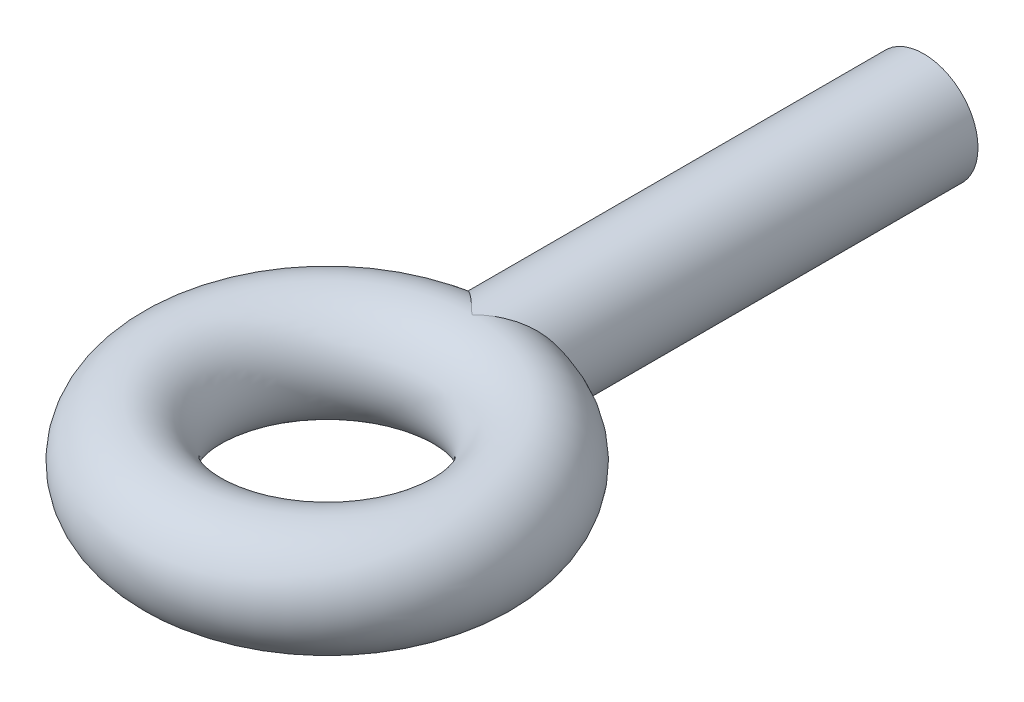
ISO-10303-21;
HEADER;
FILE_DESCRIPTION(('STEP AP214'),'2;1');
FILE_NAME('part.step','',(''),(''),'','','');
FILE_SCHEMA(('AUTOMOTIVE_DESIGN { 1 0 10303 214 1 1 1 1 }'));
ENDSEC;
DATA;
#1=APPLICATION_CONTEXT('core data for automotive mechanical design processes');
#2=APPLICATION_PROTOCOL_DEFINITION('international standard','automotive_design',2000,#1);
#3=PRODUCT_CONTEXT('',#1,'mechanical');
#4=PRODUCT('Part','Part','',(#3));
#5=PRODUCT_RELATED_PRODUCT_CATEGORY('part','',(#4));
#6=PRODUCT_DEFINITION_FORMATION('','',#4);
#7=PRODUCT_DEFINITION_CONTEXT('part definition',#1,'design');
#8=PRODUCT_DEFINITION('design','',#6,#7);
#9=PRODUCT_DEFINITION_SHAPE('','',#8);
#10=(LENGTH_UNIT() NAMED_UNIT(*) SI_UNIT(.MILLI.,.METRE.));
#11=(NAMED_UNIT(*) PLANE_ANGLE_UNIT() SI_UNIT($,.RADIAN.));
#12=(NAMED_UNIT(*) SI_UNIT($,.STERADIAN.) SOLID_ANGLE_UNIT());
#13=UNCERTAINTY_MEASURE_WITH_UNIT(LENGTH_MEASURE(1.E-05),#10,'distance_accuracy_value','');
#14=(GEOMETRIC_REPRESENTATION_CONTEXT(3) GLOBAL_UNCERTAINTY_ASSIGNED_CONTEXT((#13)) GLOBAL_UNIT_ASSIGNED_CONTEXT((#10,
#11,#12)) REPRESENTATION_CONTEXT('',''));
#15=CARTESIAN_POINT('',(0.,0.,0.));
#16=DIRECTION('',(0.,0.,1.));
#17=DIRECTION('',(1.,0.,0.));
#18=AXIS2_PLACEMENT_3D('',#15,#16,#17);
#19=CARTESIAN_POINT('',(0.,0.,66.));
#20=DIRECTION('',(0.,-1.,0.));
#21=DIRECTION('',(0.,0.,-1.));
#22=AXIS2_PLACEMENT_3D('',#19,#20,#21);
#23=TOROIDAL_SURFACE('',#22,16.,6.);
#24=CARTESIAN_POINT('',(0.,6.00000000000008,50.));
#25=CARTESIAN_POINT('',(0.00365142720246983,5.99999999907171,49.99634856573));
#26=CARTESIAN_POINT('',(0.00730353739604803,5.99999666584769,49.9926977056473));
#27=CARTESIAN_POINT('',(0.368796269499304,5.99933665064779,49.6314529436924));
#28=CARTESIAN_POINT('',(0.733142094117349,5.96666769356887,49.2794020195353));
#29=CARTESIAN_POINT('',(1.46591427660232,5.83011795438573,48.59231633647));
#30=CARTESIAN_POINT('',(1.83434639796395,5.72611920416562,48.2573107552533));
#31=CARTESIAN_POINT('',(2.51206206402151,5.45921564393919,47.6570671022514));
#32=CARTESIAN_POINT('',(2.82244829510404,5.3065091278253,47.3886042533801));
#33=CARTESIAN_POINT('',(3.42605073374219,4.93830714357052,46.8767440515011));
#34=CARTESIAN_POINT('',(3.7192920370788,4.72290635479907,46.6333096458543));
#35=CARTESIAN_POINT('',(4.22017294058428,4.27544708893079,46.2242873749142));
#36=CARTESIAN_POINT('',(4.43329412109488,4.05503493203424,46.0528121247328));
#37=CARTESIAN_POINT('',(4.73104107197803,3.69346406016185,45.8158581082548));
#38=CARTESIAN_POINT('',(4.82663415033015,3.56778183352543,45.7402499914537));
#39=CARTESIAN_POINT('',(5.00933699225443,3.30634877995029,45.5964723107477));
#40=CARTESIAN_POINT('',(5.09644796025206,3.17059938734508,45.5283016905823));
#41=CARTESIAN_POINT('',(5.24823807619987,2.91118416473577,45.4100373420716));
#42=CARTESIAN_POINT('',(5.31430804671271,2.78886159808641,45.358775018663));
#43=CARTESIAN_POINT('',(5.43862537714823,2.53790315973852,45.2626346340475));
#44=CARTESIAN_POINT('',(5.49687411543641,2.40926840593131,45.2177554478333));
#45=CARTESIAN_POINT('',(5.6047840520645,2.14629807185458,45.1348421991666));
#46=CARTESIAN_POINT('',(5.65444491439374,2.01196226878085,45.0968084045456));
#47=CARTESIAN_POINT('',(5.7444331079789,1.73844835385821,45.0280415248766));
#48=CARTESIAN_POINT('',(5.78476489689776,1.59927259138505,44.9973049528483));
#49=CARTESIAN_POINT('',(5.85567022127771,1.31624979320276,44.9433578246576));
#50=CARTESIAN_POINT('',(5.8861936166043,1.17238277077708,44.9201859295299));
#51=CARTESIAN_POINT('',(5.93668912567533,0.881745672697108,44.8818935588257));
#52=CARTESIAN_POINT('',(5.95666115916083,0.734975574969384,44.8667731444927));
#53=CARTESIAN_POINT('',(5.98569827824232,0.43978017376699,44.8448004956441));
#54=CARTESIAN_POINT('',(5.99476603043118,0.291355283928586,44.8379462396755));
#55=CARTESIAN_POINT('',(6.00183836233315,-0.00590293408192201,44.8325996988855));
#56=CARTESIAN_POINT('',(5.99984371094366,-0.154736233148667,44.8341068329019));
#57=CARTESIAN_POINT('',(5.9854629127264,-0.439047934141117,44.8449807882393));
#58=CARTESIAN_POINT('',(5.97396346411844,-0.574598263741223,44.8536769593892));
#59=CARTESIAN_POINT('',(5.94188552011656,-0.844042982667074,44.8779621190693));
#60=CARTESIAN_POINT('',(5.92130395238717,-0.977936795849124,44.8935534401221));
#61=CARTESIAN_POINT('',(5.87137303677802,-1.24304709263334,44.9314382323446));
#62=CARTESIAN_POINT('',(5.84202756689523,-1.37426473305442,44.9537287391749));
#63=CARTESIAN_POINT('',(5.77496546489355,-1.63330453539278,45.0047732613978));
#64=CARTESIAN_POINT('',(5.7372456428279,-1.76112538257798,45.0335297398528));
#65=CARTESIAN_POINT('',(5.65339744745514,-2.01422265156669,45.0976136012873));
#66=CARTESIAN_POINT('',(5.60716677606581,-2.13944489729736,45.1330210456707));
#67=CARTESIAN_POINT('',(5.50721413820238,-2.38499284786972,45.2098021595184));
#68=CARTESIAN_POINT('',(5.45348950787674,-2.50531679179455,45.2511779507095));
#69=CARTESIAN_POINT('',(5.28201866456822,-2.85806099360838,45.3836861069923));
#70=CARTESIAN_POINT('',(5.15391920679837,-3.08242031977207,45.4832420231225));
#71=CARTESIAN_POINT('',(4.85936799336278,-3.53082124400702,45.7141779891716));
#72=CARTESIAN_POINT('',(4.6901954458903,-3.75183325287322,45.8479056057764));
#73=CARTESIAN_POINT('',(4.33082673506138,-4.16151994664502,46.1352801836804));
#74=CARTESIAN_POINT('',(4.14061621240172,-4.35017231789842,46.2889407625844));
#75=CARTESIAN_POINT('',(3.79753142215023,-4.64930427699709,46.5697350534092));
#76=CARTESIAN_POINT('',(3.64805116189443,-4.76727524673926,46.6931676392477));
#77=CARTESIAN_POINT('',(3.34300981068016,-4.98593276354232,46.9476365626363));
#78=CARTESIAN_POINT('',(3.18744644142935,-5.08661275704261,47.078675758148));
#79=CARTESIAN_POINT('',(2.71386350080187,-5.36365021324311,47.4820185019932));
#80=CARTESIAN_POINT('',(2.38922614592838,-5.51477273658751,47.7643236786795));
#81=CARTESIAN_POINT('',(1.89091512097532,-5.69717392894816,48.2086312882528));
#82=CARTESIAN_POINT('',(1.71895655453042,-5.75125467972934,48.3639166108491));
#83=CARTESIAN_POINT('',(1.37478032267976,-5.84308842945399,48.6789788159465));
#84=CARTESIAN_POINT('',(1.20256265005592,-5.8808409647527,48.8387558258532));
#85=CARTESIAN_POINT('',(0.687874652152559,-5.97058674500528,49.3231942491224));
#86=CARTESIAN_POINT('',(0.346492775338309,-5.99937705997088,49.6537412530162));
#87=CARTESIAN_POINT('',(0.00730352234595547,-5.99999666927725,49.9926977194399));
#88=CARTESIAN_POINT('',(0.00365141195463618,-6.0000000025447,49.9963485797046));
#89=CARTESIAN_POINT('',(0.,-6.00000000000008,50.));
#90=B_SPLINE_CURVE_WITH_KNOTS('',3,(#24,#25,#26,#27,#28,#29,#30,#31,#32,#33,#34,#35,#36,#37,#38,
#39,#40,#41,#42,#43,#44,#45,#46,#47,#48,#49,#50,#51,#52,#53,#54,#55,#56,#57,#58,#59,#60,#61,#62,
#63,#64,#65,#66,#67,#68,#69,#70,#71,#72,#73,#74,#75,#76,#77,#78,#79,#80,#81,#82,#83,#84,#85,#86,
#87,#88,#89),.UNSPECIFIED.,.F.,.F.,(4,2,2,2,2,2,2,2,2,2,2,2,2,2,2,2,2,2,2,2,2,2,2,2,2,2,2,2,2,2,
2,2,4),(0.,0.0154919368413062,1.53313644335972,3.05329696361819,4.36213800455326,
5.66901263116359,6.71836517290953,7.24304017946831,7.76764057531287,8.21172315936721,
8.65572737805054,9.09974896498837,9.54355794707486,9.98960084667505,10.4356471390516,
10.8815843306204,11.3274905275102,11.7359514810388,12.1445507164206,12.5529694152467,
12.9615439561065,13.3753948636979,13.7893932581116,14.6168525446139,15.5398815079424,
16.4635444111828,17.1434501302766,17.8236129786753,19.1851945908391,19.8985016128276,
20.6118288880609,22.0348755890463,22.0503675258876),.UNSPECIFIED.);
#91=CARTESIAN_POINT('',(0.,6.,50.));
#92=VERTEX_POINT('',#91);
#93=CARTESIAN_POINT('',(0.,-6.,50.));
#94=VERTEX_POINT('',#93);
#95=EDGE_CURVE('E45',#92,#94,#90,.T.);
#96=ORIENTED_EDGE('',*,*,#95,.F.);
#97=CARTESIAN_POINT('',(0.,-6.00000000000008,50.));
#98=CARTESIAN_POINT('',(-0.0036514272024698,-5.99999999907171,49.99634856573));
#99=CARTESIAN_POINT('',(-0.00730353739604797,-5.99999666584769,49.9926977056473));
#100=CARTESIAN_POINT('',(-0.368796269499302,-5.99933665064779,49.6314529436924));
#101=CARTESIAN_POINT('',(-0.73314209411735,-5.96666769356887,49.2794020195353));
#102=CARTESIAN_POINT('',(-1.46591427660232,-5.83011795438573,48.59231633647));
#103=CARTESIAN_POINT('',(-1.83434639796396,-5.72611920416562,48.2573107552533));
#104=CARTESIAN_POINT('',(-2.51206206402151,-5.45921564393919,47.6570671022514));
#105=CARTESIAN_POINT('',(-2.82244829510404,-5.3065091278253,47.3886042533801));
#106=CARTESIAN_POINT('',(-3.42605073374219,-4.93830714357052,46.8767440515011));
#107=CARTESIAN_POINT('',(-3.7192920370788,-4.72290635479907,46.6333096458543));
#108=CARTESIAN_POINT('',(-4.22017294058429,-4.27544708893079,46.2242873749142));
#109=CARTESIAN_POINT('',(-4.43329412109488,-4.05503493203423,46.0528121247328));
#110=CARTESIAN_POINT('',(-4.73104107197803,-3.69346406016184,45.8158581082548));
#111=CARTESIAN_POINT('',(-4.82663415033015,-3.56778183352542,45.7402499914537));
#112=CARTESIAN_POINT('',(-5.00933699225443,-3.30634877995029,45.5964723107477));
#113=CARTESIAN_POINT('',(-5.09644796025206,-3.17059938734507,45.5283016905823));
#114=CARTESIAN_POINT('',(-5.24823807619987,-2.91118416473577,45.4100373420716));
#115=CARTESIAN_POINT('',(-5.31430804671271,-2.78886159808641,45.358775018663));
#116=CARTESIAN_POINT('',(-5.43862537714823,-2.53790315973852,45.2626346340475));
#117=CARTESIAN_POINT('',(-5.49687411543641,-2.40926840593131,45.2177554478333));
#118=CARTESIAN_POINT('',(-5.6047840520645,-2.14629807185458,45.1348421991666));
#119=CARTESIAN_POINT('',(-5.65444491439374,-2.01196226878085,45.0968084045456));
#120=CARTESIAN_POINT('',(-5.7444331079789,-1.7384483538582,45.0280415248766));
#121=CARTESIAN_POINT('',(-5.78476489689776,-1.59927259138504,44.9973049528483));
#122=CARTESIAN_POINT('',(-5.85567022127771,-1.31624979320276,44.9433578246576));
#123=CARTESIAN_POINT('',(-5.8861936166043,-1.17238277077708,44.9201859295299));
#124=CARTESIAN_POINT('',(-5.93668912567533,-0.881745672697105,44.8818935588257));
#125=CARTESIAN_POINT('',(-5.95666115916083,-0.73497557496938,44.8667731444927));
#126=CARTESIAN_POINT('',(-5.98569827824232,-0.439780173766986,44.8448004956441));
#127=CARTESIAN_POINT('',(-5.99476603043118,-0.291355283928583,44.8379462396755));
#128=CARTESIAN_POINT('',(-6.00183836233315,0.0059029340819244,44.8325996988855));
#129=CARTESIAN_POINT('',(-5.99984371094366,0.154736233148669,44.8341068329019));
#130=CARTESIAN_POINT('',(-5.9854629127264,0.439047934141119,44.8449807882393));
#131=CARTESIAN_POINT('',(-5.97396346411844,0.574598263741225,44.8536769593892));
#132=CARTESIAN_POINT('',(-5.94188552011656,0.844042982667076,44.8779621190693));
#133=CARTESIAN_POINT('',(-5.92130395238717,0.977936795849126,44.8935534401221));
#134=CARTESIAN_POINT('',(-5.87137303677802,1.24304709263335,44.9314382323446));
#135=CARTESIAN_POINT('',(-5.84202756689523,1.37426473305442,44.9537287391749));
#136=CARTESIAN_POINT('',(-5.77496546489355,1.63330453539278,45.0047732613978));
#137=CARTESIAN_POINT('',(-5.7372456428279,1.76112538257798,45.0335297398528));
#138=CARTESIAN_POINT('',(-5.65339744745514,2.0142226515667,45.0976136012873));
#139=CARTESIAN_POINT('',(-5.60716677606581,2.13944489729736,45.1330210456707));
#140=CARTESIAN_POINT('',(-5.50721413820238,2.38499284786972,45.2098021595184));
#141=CARTESIAN_POINT('',(-5.45348950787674,2.50531679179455,45.2511779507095));
#142=CARTESIAN_POINT('',(-5.28201866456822,2.85806099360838,45.3836861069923));
#143=CARTESIAN_POINT('',(-5.15391920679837,3.08242031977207,45.4832420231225));
#144=CARTESIAN_POINT('',(-4.85936799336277,3.53082124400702,45.7141779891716));
#145=CARTESIAN_POINT('',(-4.6901954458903,3.75183325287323,45.8479056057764));
#146=CARTESIAN_POINT('',(-4.33082673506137,4.16151994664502,46.1352801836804));
#147=CARTESIAN_POINT('',(-4.14061621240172,4.35017231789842,46.2889407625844));
#148=CARTESIAN_POINT('',(-3.79753142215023,4.6493042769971,46.5697350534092));
#149=CARTESIAN_POINT('',(-3.64805116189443,4.76727524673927,46.6931676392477));
#150=CARTESIAN_POINT('',(-3.34300981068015,4.98593276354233,46.9476365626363));
#151=CARTESIAN_POINT('',(-3.18744644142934,5.08661275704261,47.0786757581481));
#152=CARTESIAN_POINT('',(-2.71386350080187,5.36365021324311,47.4820185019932));
#153=CARTESIAN_POINT('',(-2.38922614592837,5.51477273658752,47.7643236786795));
#154=CARTESIAN_POINT('',(-1.89091512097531,5.69717392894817,48.2086312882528));
#155=CARTESIAN_POINT('',(-1.71895655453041,5.75125467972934,48.3639166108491));
#156=CARTESIAN_POINT('',(-1.37478032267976,5.84308842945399,48.6789788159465));
#157=CARTESIAN_POINT('',(-1.20256265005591,5.8808409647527,48.8387558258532));
#158=CARTESIAN_POINT('',(-0.687874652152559,5.97058674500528,49.3231942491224));
#159=CARTESIAN_POINT('',(-0.346492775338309,5.99937705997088,49.6537412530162));
#160=CARTESIAN_POINT('',(-0.00730352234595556,5.99999666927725,49.9926977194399));
#161=CARTESIAN_POINT('',(-0.00365141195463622,6.0000000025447,49.9963485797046));
#162=CARTESIAN_POINT('',(0.,6.00000000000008,50.));
#163=B_SPLINE_CURVE_WITH_KNOTS('',3,(#97,#98,#99,#100,#101,#102,#103,#104,#105,#106,#107,#108,
#109,#110,#111,#112,#113,#114,#115,#116,#117,#118,#119,#120,#121,#122,#123,#124,#125,#126,#127,
#128,#129,#130,#131,#132,#133,#134,#135,#136,#137,#138,#139,#140,#141,#142,#143,#144,#145,#146,
#147,#148,#149,#150,#151,#152,#153,#154,#155,#156,#157,#158,#159,#160,#161,#162),.UNSPECIFIED.,
.F.,.F.,(4,2,2,2,2,2,2,2,2,2,2,2,2,2,2,2,2,2,2,2,2,2,2,2,2,2,2,2,2,2,2,2,4),(0.,
0.0154919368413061,1.53313644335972,3.0532969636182,4.36213800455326,5.66901263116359,
6.71836517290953,7.24304017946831,7.76764057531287,8.21172315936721,8.65572737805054,
9.09974896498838,9.54355794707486,9.98960084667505,10.4356471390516,10.8815843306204,
11.3274905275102,11.7359514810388,12.1445507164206,12.5529694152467,12.9615439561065,
13.3753948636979,13.7893932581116,14.6168525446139,15.5398815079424,16.4635444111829,
17.1434501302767,17.8236129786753,19.1851945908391,19.8985016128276,20.6118288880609,
22.0348755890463,22.0503675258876),.UNSPECIFIED.);
#164=EDGE_CURVE('E52',#94,#92,#163,.T.);
#165=ORIENTED_EDGE('',*,*,#164,.F.);
#166=EDGE_LOOP('',(#96,#165));
#167=FACE_BOUND('',#166,.T.);
#168=ADVANCED_FACE('F36',(#167),#23,.T.);
#169=CARTESIAN_POINT('',(0.,0.,50.));
#170=DIRECTION('',(0.,0.,-1.));
#171=DIRECTION('',(-1.,0.,0.));
#172=AXIS2_PLACEMENT_3D('',#169,#170,#171);
#173=CYLINDRICAL_SURFACE('',#172,6.);
#174=ORIENTED_EDGE('',*,*,#164,.T.);
#175=ORIENTED_EDGE('',*,*,#95,.T.);
#176=EDGE_LOOP('',(#174,#175));
#177=FACE_BOUND('',#176,.T.);
#178=CARTESIAN_POINT('',(0.,0.,0.));
#179=DIRECTION('',(0.,0.,1.));
#180=DIRECTION('',(1.,0.,0.));
#181=AXIS2_PLACEMENT_3D('',#178,#179,#180);
#182=CIRCLE('',#181,6.);
#183=CARTESIAN_POINT('',(6.,0.,0.));
#184=VERTEX_POINT('',#183);
#185=EDGE_CURVE('E11',#184,#184,#182,.T.);
#186=ORIENTED_EDGE('',*,*,#185,.T.);
#187=EDGE_LOOP('',(#186));
#188=FACE_BOUND('',#187,.T.);
#189=ADVANCED_FACE('F38',(#177,#188),#173,.T.);
#190=CARTESIAN_POINT('',(0.,0.,0.));
#191=DIRECTION('',(0.,0.,1.));
#192=DIRECTION('',(1.,0.,0.));
#193=AXIS2_PLACEMENT_3D('',#190,#191,#192);
#194=PLANE('',#193);
#195=ORIENTED_EDGE('',*,*,#185,.F.);
#196=EDGE_LOOP('',(#195));
#197=FACE_BOUND('',#196,.T.);
#198=ADVANCED_FACE('F67',(#197),#194,.F.);
#199=CLOSED_SHELL('',(#168,#189,#198));
#200=MANIFOLD_SOLID_BREP('B2',#199);
#201=ADVANCED_BREP_SHAPE_REPRESENTATION('',(#18,#200),#14);
#202=SHAPE_DEFINITION_REPRESENTATION(#9,#201);
ENDSEC;
END-ISO-10303-21;
